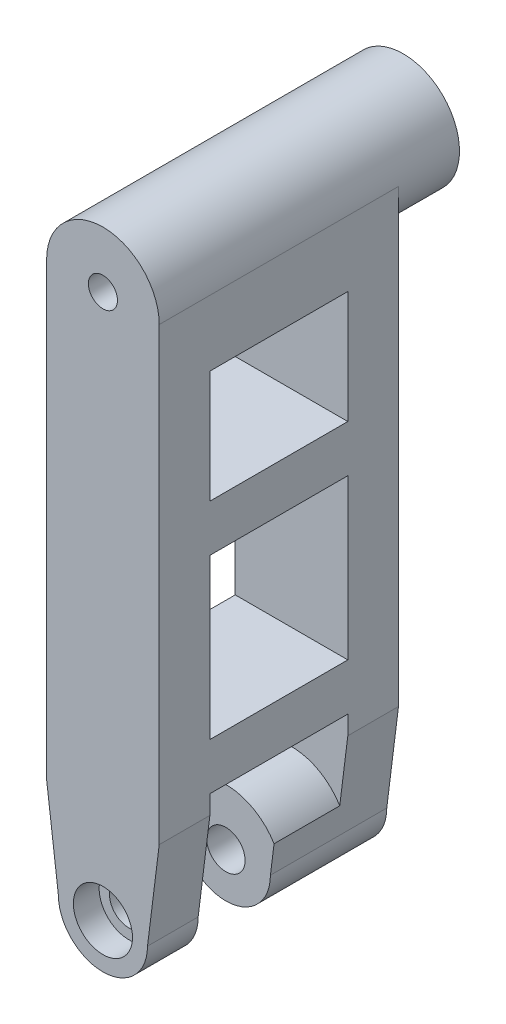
from build123d import *

# Parameters (mm, degrees)
SKETCH_1_R           = 1.55
SKETCH_1_R_2         = 2.05
EXTRUDE_7_DEPTH      = 25.5
SKETCH_6_W           = 14.7
SKETCH_6_H           = 18
SKETCH_6_H_2         = 17
SKETCH_6_H_3         = 12
CUT_EXTRUDE_1_DEPTH  = 20
EXTRUDE_8_DEPTH      = 4.05
EXTRUDE_8_DEPTH_BACK = 12.75
SKETCH_8_R           = 4.58
CUT_EXTRUDE_START    = -30
CUT_EXTRUDE_4_DEPTH  = 30
SKETCH_12_R          = 1.55
EXTRUDE_9_DEPTH      = 6.5
EXTRUDE_START        = 7
SKETCH_13_R          = 2.05
EXTRUDE_10_DEPTH     = 7
CUT_EXTRUDE_5_DEPTH  = 70.930322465
CUT_EXTRUDE_6_DEPTH  = 2.75
SKETCH_16_R          = 3.15
CUT_EXTRUDE_7_DEPTH  = 2.75


with BuildPart() as part:
    # Sketch 1 → Extrude 7 (new body)
    with BuildSketch(Plane.XY):
        with BuildLine():
            Line((0, 0), (0, 58))
            ThreePointArc((0, 58), (6, 64), (12, 58))
            Line((12, 58), (12, 0))
            ThreePointArc((12, 0), (6, -6), (0, 0))
        make_face()
        with Locations((6, 58)):
            Circle(SKETCH_1_R, mode=Mode.SUBTRACT)
        with Locations((6, 0)):
            Circle(SKETCH_1_R_2, mode=Mode.SUBTRACT)
    extrude(amount=-EXTRUDE_7_DEPTH)

    # Sketch 6 → Cut-Extrude 1 (cut)
    with BuildSketch(Plane(origin=(12, 0, 0), x_dir=(0, 0, -1), z_dir=(1, 0, 0))):
        with Locations((12.75, 3)):
            Rectangle(SKETCH_6_W, SKETCH_6_H)
        with Locations((12.75, 25.5)):
            Rectangle(SKETCH_6_W, SKETCH_6_H_2)
        with Locations((12.75, 45)):
            Rectangle(SKETCH_6_W, SKETCH_6_H_3)
    extrude(amount=-CUT_EXTRUDE_1_DEPTH, mode=Mode.SUBTRACT)

    # Sketch 8 → Extrude 8 (add, two sides: drawn at the far end of the back side and taken through both)
    with BuildSketch(Plane(origin=(0, 0, -12.75), x_dir=(-1, 0, 0), z_dir=(0, 0, -1)).offset(-EXTRUDE_8_DEPTH_BACK)):
        with BuildLine():
            Line((-12, 58), (-12, 56.499795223))
            Line((-12, 56.499795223), (-8.237778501, 61.53127993))
            Line((-8.237778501, 61.53127993), (-2.748886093, 61.53127993))
            Line((-2.748886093, 61.53127993), (0, 56.042387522))
            Line((0, 56.042387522), (0, 58))
            ThreePointArc((0, 58), (-0.381285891, 65.137203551), (-1.520803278, 72.193162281))
            ThreePointArc((-1.520803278, 72.193162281), (-12.151968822, 77.519203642), (-15.087770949, 65.996640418))
            ThreePointArc((-15.087770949, 65.996640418), (-12.798752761, 62.28604093), (-12, 58))
        make_face()
        with Locations((-9.012708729, 70.64595424)):
            Circle(SKETCH_8_R, mode=Mode.SUBTRACT)
    extrude(amount=EXTRUDE_8_DEPTH + EXTRUDE_8_DEPTH_BACK)

    # Sketch 11 → Cut-Extrude 4 (cut)
    with BuildSketch(Plane(origin=(0, 0, -16.8), x_dir=(-1, 0, 0), z_dir=(0, 0, -1)).offset(CUT_EXTRUDE_START)):
        with BuildLine():
            Line((-12, 58), (-39.780572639, 58))
            Line((-39.780572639, 58), (-39.780572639, 86.966610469))
            Line((-39.780572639, 86.966610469), (14.037554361, 86.966610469))
            Line((14.037554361, 86.966610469), (14.037554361, 58))
            Line((14.037554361, 58), (0, 58))
            ThreePointArc((0, 58), (-6, 64), (-12, 58))
        make_face()
    extrude(amount=CUT_EXTRUDE_4_DEPTH, mode=Mode.SUBTRACT)

    # Sketch 12 → Extrude 9 (add)
    with BuildSketch(Plane(origin=(0, 0, -25.5), x_dir=(-1, 0, 0), z_dir=(0, 0, -1))):
        with BuildLine():
            ThreePointArc((-12, 58), (-6, 52), (0, 58))
            ThreePointArc((0, 58), (-6, 64), (-12, 58))
        make_face()
        with Locations(Location((-6, 58, 0), (0, 0, 180))):
            Circle(SKETCH_12_R, mode=Mode.SUBTRACT)
    extrude(amount=EXTRUDE_9_DEPTH)

    # Sketch 13 → Extrude 10 (add)
    with BuildSketch(Plane.XY.offset(-20.1).offset(EXTRUDE_START)):
        with BuildLine():
            ThreePointArc((0, 0), (6, -6), (12, 0))
            ThreePointArc((12, 0), (6, 6), (0, 0))
        make_face()
        with Locations((6, 0)):
            Circle(SKETCH_13_R, mode=Mode.SUBTRACT)
    extrude(amount=-EXTRUDE_10_DEPTH)

    # Sketch 14 → Cut-Extrude 5 (cut, through all)
    with BuildSketch(Plane(origin=(0, 0, -25.5), x_dir=(-1, 0, 0), z_dir=(0, 0, -1))):
        with BuildLine():
            ThreePointArc((-1.25, 0), (-6, -4.75), (-10.75, 0))
            Line((-10.75, 0), (-12, 10))
            Line((-12, 10), (-12, 0))
            ThreePointArc((-12, 0), (-6, -6), (0, 0))
            Line((0, 0), (0, 10))
            Line((0, 10), (-1.25, 0))
        make_face()
    extrude(amount=-CUT_EXTRUDE_5_DEPTH, mode=Mode.SUBTRACT)

    # Sketch 15 → Cut-Extrude 6 (cut)
    with BuildSketch(Plane(origin=(0, 0, -25.5), x_dir=(-1, 0, 0), z_dir=(0, 0, -1))):
        Polygon((-4.325684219, 2.9), (-7.674315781, 2.9), (-9.348631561, 0), (-7.674315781, -2.9), (-4.325684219, -2.9), (-2.651368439, 0), align=None)
    extrude(amount=-CUT_EXTRUDE_6_DEPTH, mode=Mode.SUBTRACT)

    # Sketch 16 → Cut-Extrude 7 (cut)
    with BuildSketch(Plane.XY):
        with Locations((6, 0)):
            Circle(SKETCH_16_R)
    extrude(amount=-CUT_EXTRUDE_7_DEPTH, mode=Mode.SUBTRACT)


solid = part.part
